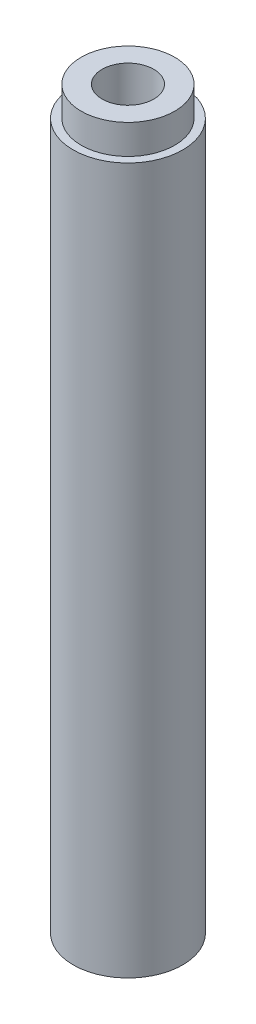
ISO-10303-21;
HEADER;
FILE_DESCRIPTION(('STEP AP214'),'2;1');
FILE_NAME('part.step','',(''),(''),'','','');
FILE_SCHEMA(('AUTOMOTIVE_DESIGN { 1 0 10303 214 1 1 1 1 }'));
ENDSEC;
DATA;
#1=APPLICATION_CONTEXT('core data for automotive mechanical design processes');
#2=APPLICATION_PROTOCOL_DEFINITION('international standard','automotive_design',2000,#1);
#3=PRODUCT_CONTEXT('',#1,'mechanical');
#4=PRODUCT('Part','Part','',(#3));
#5=PRODUCT_RELATED_PRODUCT_CATEGORY('part','',(#4));
#6=PRODUCT_DEFINITION_FORMATION('','',#4);
#7=PRODUCT_DEFINITION_CONTEXT('part definition',#1,'design');
#8=PRODUCT_DEFINITION('design','',#6,#7);
#9=PRODUCT_DEFINITION_SHAPE('','',#8);
#10=(LENGTH_UNIT() NAMED_UNIT(*) SI_UNIT(.MILLI.,.METRE.));
#11=(NAMED_UNIT(*) PLANE_ANGLE_UNIT() SI_UNIT($,.RADIAN.));
#12=(NAMED_UNIT(*) SI_UNIT($,.STERADIAN.) SOLID_ANGLE_UNIT());
#13=UNCERTAINTY_MEASURE_WITH_UNIT(LENGTH_MEASURE(1.E-05),#10,'distance_accuracy_value','');
#14=(GEOMETRIC_REPRESENTATION_CONTEXT(3) GLOBAL_UNCERTAINTY_ASSIGNED_CONTEXT((#13)) GLOBAL_UNIT_ASSIGNED_CONTEXT((#10,
#11,#12)) REPRESENTATION_CONTEXT('',''));
#15=CARTESIAN_POINT('',(0.,0.,0.));
#16=DIRECTION('',(0.,0.,1.));
#17=DIRECTION('',(1.,0.,0.));
#18=AXIS2_PLACEMENT_3D('',#15,#16,#17);
#19=CARTESIAN_POINT('',(0.,-75.8698,0.));
#20=DIRECTION('',(0.,1.,0.));
#21=DIRECTION('',(0.,0.,1.));
#22=AXIS2_PLACEMENT_3D('',#19,#20,#21);
#23=CYLINDRICAL_SURFACE('',#22,5.6515);
#24=CARTESIAN_POINT('',(0.,-75.8698,0.));
#25=DIRECTION('',(0.,1.,0.));
#26=DIRECTION('',(0.,0.,1.));
#27=AXIS2_PLACEMENT_3D('',#24,#25,#26);
#28=CIRCLE('',#27,5.6515);
#29=CARTESIAN_POINT('',(0.,-75.8698,5.6515));
#30=VERTEX_POINT('',#29);
#31=EDGE_CURVE('E10',#30,#30,#28,.T.);
#32=ORIENTED_EDGE('',*,*,#31,.T.);
#33=EDGE_LOOP('',(#32));
#34=FACE_BOUND('',#33,.T.);
#35=CARTESIAN_POINT('',(0.,-3.048,0.));
#36=DIRECTION('',(0.,1.,0.));
#37=DIRECTION('',(0.,0.,1.));
#38=AXIS2_PLACEMENT_3D('',#35,#36,#37);
#39=CIRCLE('',#38,5.6515);
#40=CARTESIAN_POINT('',(0.,-3.048,5.6515));
#41=VERTEX_POINT('',#40);
#42=EDGE_CURVE('E36',#41,#41,#39,.T.);
#43=ORIENTED_EDGE('',*,*,#42,.F.);
#44=EDGE_LOOP('',(#43));
#45=FACE_BOUND('',#44,.T.);
#46=ADVANCED_FACE('F30',(#34,#45),#23,.T.);
#47=CARTESIAN_POINT('',(0.,-75.8698,0.));
#48=DIRECTION('',(0.,1.,0.));
#49=DIRECTION('',(0.,0.,1.));
#50=AXIS2_PLACEMENT_3D('',#47,#48,#49);
#51=PLANE('',#50);
#52=CARTESIAN_POINT('',(0.,-75.8698,0.));
#53=DIRECTION('',(0.,-1.,0.));
#54=DIRECTION('',(0.,0.,-1.));
#55=AXIS2_PLACEMENT_3D('',#52,#53,#54);
#56=CIRCLE('',#55,2.667);
#57=CARTESIAN_POINT('',(0.,-75.8698,-2.667));
#58=VERTEX_POINT('',#57);
#59=EDGE_CURVE('E56',#58,#58,#56,.T.);
#60=ORIENTED_EDGE('',*,*,#59,.F.);
#61=EDGE_LOOP('',(#60));
#62=FACE_BOUND('',#61,.T.);
#63=ORIENTED_EDGE('',*,*,#31,.F.);
#64=EDGE_LOOP('',(#63));
#65=FACE_BOUND('',#64,.T.);
#66=ADVANCED_FACE('F71',(#62,#65),#51,.F.);
#67=CARTESIAN_POINT('',(0.,-3.048,0.));
#68=DIRECTION('',(0.,1.,0.));
#69=DIRECTION('',(0.,0.,1.));
#70=AXIS2_PLACEMENT_3D('',#67,#68,#69);
#71=PLANE('',#70);
#72=CARTESIAN_POINT('',(0.,-3.048,0.));
#73=DIRECTION('',(0.,1.,0.));
#74=DIRECTION('',(0.,0.,1.));
#75=AXIS2_PLACEMENT_3D('',#72,#73,#74);
#76=CIRCLE('',#75,4.826);
#77=CARTESIAN_POINT('',(0.,-3.048,4.826));
#78=VERTEX_POINT('',#77);
#79=EDGE_CURVE('E40',#78,#78,#76,.T.);
#80=ORIENTED_EDGE('',*,*,#79,.F.);
#81=EDGE_LOOP('',(#80));
#82=FACE_BOUND('',#81,.T.);
#83=ORIENTED_EDGE('',*,*,#42,.T.);
#84=EDGE_LOOP('',(#83));
#85=FACE_BOUND('',#84,.T.);
#86=ADVANCED_FACE('F74',(#82,#85),#71,.T.);
#87=CARTESIAN_POINT('',(0.,-3.048,0.));
#88=DIRECTION('',(0.,1.,0.));
#89=DIRECTION('',(0.,0.,1.));
#90=AXIS2_PLACEMENT_3D('',#87,#88,#89);
#91=CYLINDRICAL_SURFACE('',#90,4.826);
#92=CARTESIAN_POINT('',(0.,0.,0.));
#93=DIRECTION('',(0.,1.,0.));
#94=DIRECTION('',(0.,0.,1.));
#95=AXIS2_PLACEMENT_3D('',#92,#93,#94);
#96=CIRCLE('',#95,4.826);
#97=CARTESIAN_POINT('',(0.,0.,4.826));
#98=VERTEX_POINT('',#97);
#99=EDGE_CURVE('E44',#98,#98,#96,.T.);
#100=CARTESIAN_POINT('',(0.,-3.048,4.826));
#101=CARTESIAN_POINT('',(0.,-3.01625,4.826));
#102=CARTESIAN_POINT('',(0.,-2.9845,4.826));
#103=CARTESIAN_POINT('',(0.,-2.921,4.826));
#104=CARTESIAN_POINT('',(0.,-2.88925,4.826));
#105=CARTESIAN_POINT('',(0.,-2.82575,4.826));
#106=CARTESIAN_POINT('',(0.,-2.794,4.826));
#107=CARTESIAN_POINT('',(0.,-2.7305,4.826));
#108=CARTESIAN_POINT('',(0.,-2.69875,4.826));
#109=CARTESIAN_POINT('',(0.,-2.63525,4.826));
#110=CARTESIAN_POINT('',(0.,-2.6035,4.826));
#111=CARTESIAN_POINT('',(0.,-2.54,4.826));
#112=CARTESIAN_POINT('',(0.,-2.50825,4.826));
#113=CARTESIAN_POINT('',(0.,-2.44475,4.826));
#114=CARTESIAN_POINT('',(0.,-2.413,4.826));
#115=CARTESIAN_POINT('',(0.,-2.3495,4.826));
#116=CARTESIAN_POINT('',(0.,-2.31775,4.826));
#117=CARTESIAN_POINT('',(0.,-2.25425,4.826));
#118=CARTESIAN_POINT('',(0.,-2.2225,4.826));
#119=CARTESIAN_POINT('',(0.,-2.159,4.826));
#120=CARTESIAN_POINT('',(0.,-2.12725,4.826));
#121=CARTESIAN_POINT('',(0.,-2.06375,4.826));
#122=CARTESIAN_POINT('',(0.,-2.032,4.826));
#123=CARTESIAN_POINT('',(0.,-1.9685,4.826));
#124=CARTESIAN_POINT('',(0.,-1.93675,4.826));
#125=CARTESIAN_POINT('',(0.,-1.87325,4.826));
#126=CARTESIAN_POINT('',(0.,-1.8415,4.826));
#127=CARTESIAN_POINT('',(0.,-1.778,4.826));
#128=CARTESIAN_POINT('',(0.,-1.74625,4.826));
#129=CARTESIAN_POINT('',(0.,-1.68275,4.826));
#130=CARTESIAN_POINT('',(0.,-1.651,4.826));
#131=CARTESIAN_POINT('',(0.,-1.5875,4.826));
#132=CARTESIAN_POINT('',(0.,-1.55575,4.826));
#133=CARTESIAN_POINT('',(0.,-1.49225,4.826));
#134=CARTESIAN_POINT('',(0.,-1.4605,4.826));
#135=CARTESIAN_POINT('',(0.,-1.397,4.826));
#136=CARTESIAN_POINT('',(0.,-1.36525,4.826));
#137=CARTESIAN_POINT('',(0.,-1.30175,4.826));
#138=CARTESIAN_POINT('',(0.,-1.27,4.826));
#139=CARTESIAN_POINT('',(0.,-1.2065,4.826));
#140=CARTESIAN_POINT('',(0.,-1.17475,4.826));
#141=CARTESIAN_POINT('',(0.,-1.11125,4.826));
#142=CARTESIAN_POINT('',(0.,-1.0795,4.826));
#143=CARTESIAN_POINT('',(0.,-1.016,4.826));
#144=CARTESIAN_POINT('',(0.,-0.98425,4.826));
#145=CARTESIAN_POINT('',(0.,-0.92075,4.826));
#146=CARTESIAN_POINT('',(0.,-0.889,4.826));
#147=CARTESIAN_POINT('',(0.,-0.8255,4.826));
#148=CARTESIAN_POINT('',(0.,-0.79375,4.826));
#149=CARTESIAN_POINT('',(0.,-0.73025,4.826));
#150=CARTESIAN_POINT('',(0.,-0.6985,4.826));
#151=CARTESIAN_POINT('',(0.,-0.635,4.826));
#152=CARTESIAN_POINT('',(0.,-0.60325,4.826));
#153=CARTESIAN_POINT('',(0.,-0.53975,4.826));
#154=CARTESIAN_POINT('',(0.,-0.508,4.826));
#155=CARTESIAN_POINT('',(0.,-0.4445,4.826));
#156=CARTESIAN_POINT('',(0.,-0.41275,4.826));
#157=CARTESIAN_POINT('',(0.,-0.34925,4.826));
#158=CARTESIAN_POINT('',(0.,-0.3175,4.826));
#159=CARTESIAN_POINT('',(0.,-0.254,4.826));
#160=CARTESIAN_POINT('',(0.,-0.22225,4.826));
#161=CARTESIAN_POINT('',(0.,-0.15875,4.826));
#162=CARTESIAN_POINT('',(0.,-0.127,4.826));
#163=CARTESIAN_POINT('',(0.,-0.0634999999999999,4.826));
#164=CARTESIAN_POINT('',(0.,-0.03175,4.826));
#165=CARTESIAN_POINT('',(0.,0.,4.826));
#166=B_SPLINE_CURVE_WITH_KNOTS('',3,(#100,#101,#102,#103,#104,#105,#106,#107,#108,#109,#110,
#111,#112,#113,#114,#115,#116,#117,#118,#119,#120,#121,#122,#123,#124,#125,#126,#127,#128,#129,
#130,#131,#132,#133,#134,#135,#136,#137,#138,#139,#140,#141,#142,#143,#144,#145,#146,#147,#148,
#149,#150,#151,#152,#153,#154,#155,#156,#157,#158,#159,#160,#161,#162,#163,#164,#165),
.UNSPECIFIED.,.F.,.F.,(4,2,2,2,2,2,2,2,2,2,2,2,2,2,2,2,2,2,2,2,2,2,2,2,2,2,2,2,2,2,2,2,4),(0.,
0.0952500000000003,0.1905,0.28575,0.381,0.47625,0.5715,0.66675,0.762000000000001,0.85725,0.9525,
1.04775,1.143,1.23825,1.3335,1.42875,1.524,1.61925,1.7145,1.80975,1.905,2.00025,2.0955,2.19075,
2.286,2.38125,2.4765,2.57175,2.667,2.76225,2.8575,2.95275,3.048),.UNSPECIFIED.);
#167=EDGE_CURVE('BSEAM80',#78,#98,#166,.T.);
#168=ORIENTED_EDGE('',*,*,#79,.T.);
#169=ORIENTED_EDGE('',*,*,#99,.F.);
#170=ORIENTED_EDGE('',*,*,#167,.T.);
#171=ORIENTED_EDGE('',*,*,#167,.F.);
#172=EDGE_LOOP('',(#168,#170,#169,#171));
#173=FACE_BOUND('',#172,.T.);
#174=ADVANCED_FACE('F80',(#173),#91,.T.);
#175=CARTESIAN_POINT('',(0.,0.,0.));
#176=DIRECTION('',(0.,1.,0.));
#177=DIRECTION('',(0.,0.,1.));
#178=AXIS2_PLACEMENT_3D('',#175,#176,#177);
#179=PLANE('',#178);
#180=CARTESIAN_POINT('',(0.,0.,0.));
#181=DIRECTION('',(0.,1.,0.));
#182=DIRECTION('',(0.,0.,1.));
#183=AXIS2_PLACEMENT_3D('',#180,#181,#182);
#184=CIRCLE('',#183,2.667);
#185=CARTESIAN_POINT('',(0.,0.,2.667));
#186=VERTEX_POINT('',#185);
#187=EDGE_CURVE('E50',#186,#186,#184,.T.);
#188=ORIENTED_EDGE('',*,*,#187,.F.);
#189=EDGE_LOOP('',(#188));
#190=FACE_BOUND('',#189,.T.);
#191=ORIENTED_EDGE('',*,*,#99,.T.);
#192=EDGE_LOOP('',(#191));
#193=FACE_BOUND('',#192,.T.);
#194=ADVANCED_FACE('F84',(#190,#193),#179,.T.);
#195=CARTESIAN_POINT('',(0.,-24.257,0.));
#196=DIRECTION('',(0.,1.,0.));
#197=DIRECTION('',(0.,0.,1.));
#198=AXIS2_PLACEMENT_3D('',#195,#196,#197);
#199=CYLINDRICAL_SURFACE('',#198,2.667);
#200=CARTESIAN_POINT('',(0.,-24.257,0.));
#201=DIRECTION('',(0.,1.,0.));
#202=DIRECTION('',(0.,0.,1.));
#203=AXIS2_PLACEMENT_3D('',#200,#201,#202);
#204=CIRCLE('',#203,2.667);
#205=CARTESIAN_POINT('',(0.,-24.257,2.667));
#206=VERTEX_POINT('',#205);
#207=EDGE_CURVE('E48',#206,#206,#204,.T.);
#208=ORIENTED_EDGE('',*,*,#207,.F.);
#209=EDGE_LOOP('',(#208));
#210=FACE_BOUND('',#209,.T.);
#211=ORIENTED_EDGE('',*,*,#187,.T.);
#212=EDGE_LOOP('',(#211));
#213=FACE_BOUND('',#212,.T.);
#214=ADVANCED_FACE('F86',(#210,#213),#199,.F.);
#215=CARTESIAN_POINT('',(0.,-24.257,0.));
#216=DIRECTION('',(0.,1.,0.));
#217=DIRECTION('',(0.,0.,1.));
#218=AXIS2_PLACEMENT_3D('',#215,#216,#217);
#219=PLANE('',#218);
#220=ORIENTED_EDGE('',*,*,#207,.T.);
#221=EDGE_LOOP('',(#220));
#222=FACE_BOUND('',#221,.T.);
#223=ADVANCED_FACE('F67',(#222),#219,.T.);
#224=CARTESIAN_POINT('',(0.,-51.6128,0.));
#225=DIRECTION('',(0.,-1.,0.));
#226=DIRECTION('',(0.,0.,-1.));
#227=AXIS2_PLACEMENT_3D('',#224,#225,#226);
#228=CYLINDRICAL_SURFACE('',#227,2.667);
#229=CARTESIAN_POINT('',(0.,-51.6128,0.));
#230=DIRECTION('',(0.,-1.,0.));
#231=DIRECTION('',(0.,0.,-1.));
#232=AXIS2_PLACEMENT_3D('',#229,#230,#231);
#233=CIRCLE('',#232,2.667);
#234=CARTESIAN_POINT('',(0.,-51.6128,-2.667));
#235=VERTEX_POINT('',#234);
#236=EDGE_CURVE('E53',#235,#235,#233,.T.);
#237=ORIENTED_EDGE('',*,*,#236,.F.);
#238=EDGE_LOOP('',(#237));
#239=FACE_BOUND('',#238,.T.);
#240=ORIENTED_EDGE('',*,*,#59,.T.);
#241=EDGE_LOOP('',(#240));
#242=FACE_BOUND('',#241,.T.);
#243=ADVANCED_FACE('F64',(#239,#242),#228,.F.);
#244=CARTESIAN_POINT('',(0.,-51.6128,0.));
#245=DIRECTION('',(0.,-1.,0.));
#246=DIRECTION('',(0.,0.,-1.));
#247=AXIS2_PLACEMENT_3D('',#244,#245,#246);
#248=PLANE('',#247);
#249=ORIENTED_EDGE('',*,*,#236,.T.);
#250=EDGE_LOOP('',(#249));
#251=FACE_BOUND('',#250,.T.);
#252=ADVANCED_FACE('F62',(#251),#248,.T.);
#253=CLOSED_SHELL('',(#46,#66,#86,#174,#194,#214,#223,#243,#252));
#254=MANIFOLD_SOLID_BREP('B2',#253);
#255=ADVANCED_BREP_SHAPE_REPRESENTATION('',(#18,#254),#14);
#256=SHAPE_DEFINITION_REPRESENTATION(#9,#255);
ENDSEC;
END-ISO-10303-21;
